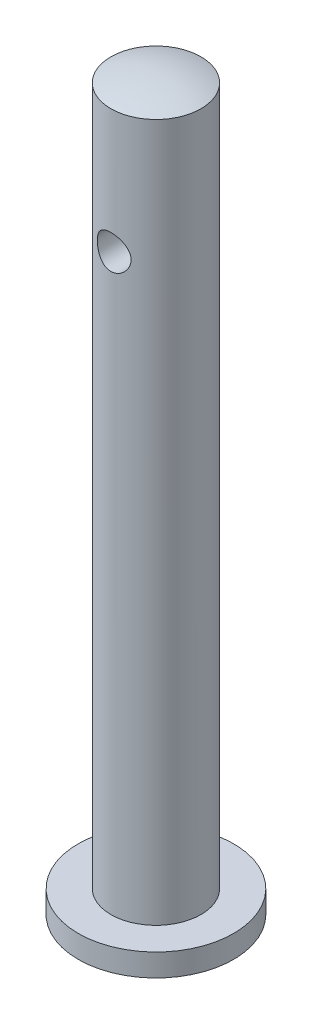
ISO-10303-21;
HEADER;
FILE_DESCRIPTION(('STEP AP214'),'2;1');
FILE_NAME('part.step','',(''),(''),'','','');
FILE_SCHEMA(('AUTOMOTIVE_DESIGN { 1 0 10303 214 1 1 1 1 }'));
ENDSEC;
DATA;
#1=APPLICATION_CONTEXT('core data for automotive mechanical design processes');
#2=APPLICATION_PROTOCOL_DEFINITION('international standard','automotive_design',2000,#1);
#3=PRODUCT_CONTEXT('',#1,'mechanical');
#4=PRODUCT('Part','Part','',(#3));
#5=PRODUCT_RELATED_PRODUCT_CATEGORY('part','',(#4));
#6=PRODUCT_DEFINITION_FORMATION('','',#4);
#7=PRODUCT_DEFINITION_CONTEXT('part definition',#1,'design');
#8=PRODUCT_DEFINITION('design','',#6,#7);
#9=PRODUCT_DEFINITION_SHAPE('','',#8);
#10=(LENGTH_UNIT() NAMED_UNIT(*) SI_UNIT(.MILLI.,.METRE.));
#11=(NAMED_UNIT(*) PLANE_ANGLE_UNIT() SI_UNIT($,.RADIAN.));
#12=(NAMED_UNIT(*) SI_UNIT($,.STERADIAN.) SOLID_ANGLE_UNIT());
#13=UNCERTAINTY_MEASURE_WITH_UNIT(LENGTH_MEASURE(1.E-05),#10,'distance_accuracy_value','');
#14=(GEOMETRIC_REPRESENTATION_CONTEXT(3) GLOBAL_UNCERTAINTY_ASSIGNED_CONTEXT((#13)) GLOBAL_UNIT_ASSIGNED_CONTEXT((#10,
#11,#12)) REPRESENTATION_CONTEXT('',''));
#15=CARTESIAN_POINT('',(0.,0.,0.));
#16=DIRECTION('',(0.,0.,1.));
#17=DIRECTION('',(1.,0.,0.));
#18=AXIS2_PLACEMENT_3D('',#15,#16,#17);
#19=CARTESIAN_POINT('',(-74.1520625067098,48.7236234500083,0.));
#20=DIRECTION('',(0.,1.,0.));
#21=DIRECTION('',(-1.,0.,0.));
#22=AXIS2_PLACEMENT_3D('',#19,#20,#21);
#23=SPHERICAL_SURFACE('',#22,11.6577075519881);
#24=CARTESIAN_POINT('',(-74.1520625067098,59.6736072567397,0.));
#25=DIRECTION('',(0.,1.,0.));
#26=DIRECTION('',(0.,0.,1.));
#27=AXIS2_PLACEMENT_3D('',#24,#25,#26);
#28=CIRCLE('',#27,4.);
#29=CARTESIAN_POINT('',(-74.1520625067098,59.6736072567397,4.));
#30=VERTEX_POINT('',#29);
#31=EDGE_CURVE('E10',#30,#30,#28,.T.);
#32=ORIENTED_EDGE('',*,*,#31,.T.);
#33=EDGE_LOOP('',(#32));
#34=FACE_BOUND('',#33,.T.);
#35=ADVANCED_FACE('F26',(#34),#23,.T.);
#36=CARTESIAN_POINT('',(-74.1520625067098,66.4098440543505,0.));
#37=DIRECTION('',(0.,1.,0.));
#38=DIRECTION('',(0.,0.,1.));
#39=AXIS2_PLACEMENT_3D('',#36,#37,#38);
#40=CYLINDRICAL_SURFACE('',#39,4.);
#41=CARTESIAN_POINT('',(-74.1520625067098,47.1557080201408,4.));
#42=CARTESIAN_POINT('',(-74.070827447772,47.1557051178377,4.00000217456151));
#43=CARTESIAN_POINT('',(-73.989612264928,47.1623277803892,3.99750379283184));
#44=CARTESIAN_POINT('',(-73.8296090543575,47.1885362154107,3.98778696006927));
#45=CARTESIAN_POINT('',(-73.7508206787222,47.2081201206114,3.98056918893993));
#46=CARTESIAN_POINT('',(-73.598001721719,47.2594610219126,3.96218832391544));
#47=CARTESIAN_POINT('',(-73.5239622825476,47.2911945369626,3.9510328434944));
#48=CARTESIAN_POINT('',(-73.3822631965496,47.3658144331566,3.92588767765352));
#49=CARTESIAN_POINT('',(-73.3146052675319,47.408703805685,3.91189723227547));
#50=CARTESIAN_POINT('',(-73.184716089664,47.5063205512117,3.88186246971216));
#51=CARTESIAN_POINT('',(-73.1227917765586,47.5614382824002,3.86576002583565));
#52=CARTESIAN_POINT('',(-73.0088182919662,47.6811184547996,3.83360220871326));
#53=CARTESIAN_POINT('',(-72.9567721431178,47.7456837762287,3.81754685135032));
#54=CARTESIAN_POINT('',(-72.86208048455,47.885425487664,3.78662470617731));
#55=CARTESIAN_POINT('',(-72.8198685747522,47.9609123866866,3.77182648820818));
#56=CARTESIAN_POINT('',(-72.748876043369,48.1185563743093,3.74599860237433));
#57=CARTESIAN_POINT('',(-72.7200900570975,48.2007107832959,3.73496742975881));
#58=CARTESIAN_POINT('',(-72.6779781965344,48.365824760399,3.71854412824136));
#59=CARTESIAN_POINT('',(-72.6640665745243,48.4486130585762,3.71293924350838));
#60=CARTESIAN_POINT('',(-72.6502669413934,48.6155241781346,3.70738061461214));
#61=CARTESIAN_POINT('',(-72.6503731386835,48.6996464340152,3.70742453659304));
#62=CARTESIAN_POINT('',(-72.6641582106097,48.8614775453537,3.71297511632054));
#63=CARTESIAN_POINT('',(-72.6770244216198,48.939268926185,3.71815468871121));
#64=CARTESIAN_POINT('',(-72.7146208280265,49.0914951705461,3.73284938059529));
#65=CARTESIAN_POINT('',(-72.7393528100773,49.1659295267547,3.74236515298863));
#66=CARTESIAN_POINT('',(-72.8004250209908,49.310985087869,3.76485702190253));
#67=CARTESIAN_POINT('',(-72.8369760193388,49.3815075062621,3.77789517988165));
#68=CARTESIAN_POINT('',(-72.9205017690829,49.5156537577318,3.80594210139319));
#69=CARTESIAN_POINT('',(-72.9674801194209,49.5792751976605,3.82095154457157));
#70=CARTESIAN_POINT('',(-73.0742446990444,49.7023116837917,3.85248038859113));
#71=CARTESIAN_POINT('',(-73.1346795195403,49.7611566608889,3.8690334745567));
#72=CARTESIAN_POINT('',(-73.2647499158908,49.8680459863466,3.90091728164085));
#73=CARTESIAN_POINT('',(-73.3343869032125,49.9160886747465,3.91624781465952));
#74=CARTESIAN_POINT('',(-73.4823390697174,50.0006384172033,3.9442639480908));
#75=CARTESIAN_POINT('',(-73.5607717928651,50.0369556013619,3.95690498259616));
#76=CARTESIAN_POINT('',(-73.7232256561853,50.0956906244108,3.97778718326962));
#77=CARTESIAN_POINT('',(-73.8072442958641,50.1181146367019,3.98603030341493));
#78=CARTESIAN_POINT('',(-73.9736872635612,50.1473308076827,3.99684443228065));
#79=CARTESIAN_POINT('',(-74.0559588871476,50.1548906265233,3.99969369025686));
#80=CARTESIAN_POINT('',(-74.2206349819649,50.1563990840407,4.00025893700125));
#81=CARTESIAN_POINT('',(-74.3030394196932,50.1503507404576,3.99797606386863));
#82=CARTESIAN_POINT('',(-74.4623245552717,50.1253979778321,3.98871709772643));
#83=CARTESIAN_POINT('',(-74.5392958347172,50.1069964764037,3.98192470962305));
#84=CARTESIAN_POINT('',(-74.6890042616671,50.0585219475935,3.96451477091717));
#85=CARTESIAN_POINT('',(-74.7617408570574,50.0284474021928,3.9538967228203));
#86=CARTESIAN_POINT('',(-74.90331027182,49.9565216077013,3.92949624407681));
#87=CARTESIAN_POINT('',(-74.9719655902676,49.9143502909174,3.91563000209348));
#88=CARTESIAN_POINT('',(-75.1014552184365,49.8197899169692,3.88626671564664));
#89=CARTESIAN_POINT('',(-75.1622866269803,49.7673970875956,3.87076907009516));
#90=CARTESIAN_POINT('',(-75.2780933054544,49.6503038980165,3.83873329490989));
#91=CARTESIAN_POINT('',(-75.3325240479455,49.5850658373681,3.82218696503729));
#92=CARTESIAN_POINT('',(-75.4297730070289,49.4460566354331,3.79078815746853));
#93=CARTESIAN_POINT('',(-75.472590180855,49.3722847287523,3.77593583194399));
#94=CARTESIAN_POINT('',(-75.5454402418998,49.2176920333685,3.74966829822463));
#95=CARTESIAN_POINT('',(-75.575419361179,49.1368432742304,3.73826760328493));
#96=CARTESIAN_POINT('',(-75.6211413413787,48.970698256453,3.72054032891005));
#97=CARTESIAN_POINT('',(-75.6368930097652,48.8854047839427,3.7142106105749));
#98=CARTESIAN_POINT('',(-75.6529259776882,48.7186918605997,3.70775894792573));
#99=CARTESIAN_POINT('',(-75.6541358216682,48.6373753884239,3.70726444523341));
#100=CARTESIAN_POINT('',(-75.6434296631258,48.4757627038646,3.71158412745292));
#101=CARTESIAN_POINT('',(-75.6315149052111,48.3954663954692,3.71639780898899));
#102=CARTESIAN_POINT('',(-75.5956206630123,48.2406607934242,3.73048141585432));
#103=CARTESIAN_POINT('',(-75.5720204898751,48.1660496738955,3.73961085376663));
#104=CARTESIAN_POINT('',(-75.513759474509,48.0218025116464,3.76121548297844));
#105=CARTESIAN_POINT('',(-75.4790958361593,47.9521677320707,3.77369151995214));
#106=CARTESIAN_POINT('',(-75.3975832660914,47.8158812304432,3.80139723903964));
#107=CARTESIAN_POINT('',(-75.3501908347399,47.7495772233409,3.81673698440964));
#108=CARTESIAN_POINT('',(-75.2454073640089,47.6255664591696,3.84806246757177));
#109=CARTESIAN_POINT('',(-75.1880131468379,47.567862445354,3.86404840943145));
#110=CARTESIAN_POINT('',(-75.0611429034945,47.459506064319,3.89590424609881));
#111=CARTESIAN_POINT('',(-74.9911811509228,47.4094042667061,3.91172104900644));
#112=CARTESIAN_POINT('',(-74.8432757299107,47.3216853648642,3.9405451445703));
#113=CARTESIAN_POINT('',(-74.7653314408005,47.2840692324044,3.95355221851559));
#114=CARTESIAN_POINT('',(-74.6000615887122,47.2213311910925,3.9757429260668));
#115=CARTESIAN_POINT('',(-74.5124759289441,47.1968209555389,3.98473657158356));
#116=CARTESIAN_POINT('',(-74.3339382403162,47.1640150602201,3.99686242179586));
#117=CARTESIAN_POINT('',(-74.2429879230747,47.1557112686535,3.99999756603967));
#118=CARTESIAN_POINT('',(-74.1520625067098,47.1557080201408,4.));
#119=B_SPLINE_CURVE_WITH_KNOTS('',3,(#41,#42,#43,#44,#45,#46,#47,#48,#49,#50,#51,#52,#53,#54,
#55,#56,#57,#58,#59,#60,#61,#62,#63,#64,#65,#66,#67,#68,#69,#70,#71,#72,#73,#74,#75,#76,#77,#78,
#79,#80,#81,#82,#83,#84,#85,#86,#87,#88,#89,#90,#91,#92,#93,#94,#95,#96,#97,#98,#99,#100,#101,
#102,#103,#104,#105,#106,#107,#108,#109,#110,#111,#112,#113,#114,#115,#116,#117,#118),
.UNSPECIFIED.,.T.,.F.,(4,2,2,2,2,2,2,2,2,2,2,2,2,2,2,2,2,2,2,2,2,2,2,2,2,2,2,2,2,2,2,2,2,2,2,2,
2,2,4),(0.,0.243369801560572,0.48670454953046,0.729571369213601,0.972503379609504,
1.22473618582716,1.47704604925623,1.73896674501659,2.00078269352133,2.251858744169,
2.50283106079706,2.73878345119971,2.97477138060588,3.21522408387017,3.45575990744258,
3.71246153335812,3.96920257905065,4.22991375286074,4.49050899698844,4.73725019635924,
4.9839366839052,5.22114437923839,5.45838293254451,5.70259221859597,5.94689180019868,
6.20536519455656,6.46386178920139,6.72343066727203,6.98283874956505,7.2255876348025,
7.46831350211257,7.70363142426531,7.93900886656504,8.1867247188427,8.43451941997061,
8.69572329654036,8.95694749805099,9.22948515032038,9.50188601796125),.UNSPECIFIED.);
#120=CARTESIAN_POINT('',(-74.1520625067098,47.1557080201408,4.));
#121=VERTEX_POINT('',#120);
#122=EDGE_CURVE('E29',#121,#121,#119,.T.);
#123=ORIENTED_EDGE('',*,*,#122,.F.);
#124=EDGE_LOOP('',(#123));
#125=FACE_BOUND('',#124,.T.);
#126=CARTESIAN_POINT('',(-72.6520625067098,48.6557080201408,-3.70809924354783));
#127=CARTESIAN_POINT('',(-72.6520594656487,48.57470053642,-3.70809640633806));
#128=CARTESIAN_POINT('',(-72.658646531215,48.4937130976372,-3.71078260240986));
#129=CARTESIAN_POINT('',(-72.6847006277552,48.3341799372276,-3.72116159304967));
#130=CARTESIAN_POINT('',(-72.7041672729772,48.2556341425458,-3.72885423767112));
#131=CARTESIAN_POINT('',(-72.7551659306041,48.1033326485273,-3.748254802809));
#132=CARTESIAN_POINT('',(-72.7866690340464,48.0295659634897,-3.7599530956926));
#133=CARTESIAN_POINT('',(-72.8607439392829,47.8883361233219,-3.78603134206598));
#134=CARTESIAN_POINT('',(-72.9033190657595,47.8208748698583,-3.80041210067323));
#135=CARTESIAN_POINT('',(-73.0005958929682,47.690817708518,-3.83103574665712));
#136=CARTESIAN_POINT('',(-73.0557586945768,47.6285794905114,-3.84733341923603));
#137=CARTESIAN_POINT('',(-73.1756666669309,47.5139852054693,-3.87949750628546));
#138=CARTESIAN_POINT('',(-73.2404138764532,47.4616312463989,-3.89536382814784));
#139=CARTESIAN_POINT('',(-73.3803678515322,47.3665685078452,-3.92552873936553));
#140=CARTESIAN_POINT('',(-73.4558555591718,47.3242485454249,-3.93975561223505));
#141=CARTESIAN_POINT('',(-73.6135067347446,47.2530568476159,-3.96438007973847));
#142=CARTESIAN_POINT('',(-73.6956678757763,47.2241804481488,-3.97477900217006));
#143=CARTESIAN_POINT('',(-73.860573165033,47.1819501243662,-3.99018697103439));
#144=CARTESIAN_POINT('',(-73.9431393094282,47.1679803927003,-3.99540915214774));
#145=CARTESIAN_POINT('',(-74.1095981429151,47.1539868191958,-4.0006401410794));
#146=CARTESIAN_POINT('',(-74.1934903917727,47.1539584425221,-4.00065064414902));
#147=CARTESIAN_POINT('',(-74.3558060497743,47.167489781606,-3.99559265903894));
#148=CARTESIAN_POINT('',(-74.4342946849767,47.1803773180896,-3.99077541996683));
#149=CARTESIAN_POINT('',(-74.5879017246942,47.2182439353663,-3.97693274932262));
#150=CARTESIAN_POINT('',(-74.6630198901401,47.2432238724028,-3.96790701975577));
#151=CARTESIAN_POINT('',(-74.8090515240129,47.3048784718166,-3.9463776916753));
#152=CARTESIAN_POINT('',(-74.8798878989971,47.3417180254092,-3.93382539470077));
#153=CARTESIAN_POINT('',(-75.0145491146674,47.4259001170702,-3.90651310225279));
#154=CARTESIAN_POINT('',(-75.0783716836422,47.4732460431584,-3.8917523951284));
#155=CARTESIAN_POINT('',(-75.2011529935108,47.580335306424,-3.86052529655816));
#156=CARTESIAN_POINT('',(-75.2596086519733,47.6406419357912,-3.84400963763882));
#157=CARTESIAN_POINT('',(-75.3657664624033,47.7703010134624,-3.81182460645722));
#158=CARTESIAN_POINT('',(-75.4134659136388,47.8396557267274,-3.79615544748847));
#159=CARTESIAN_POINT('',(-75.4977186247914,47.9874274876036,-3.76712703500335));
#160=CARTESIAN_POINT('',(-75.5340009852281,48.0660115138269,-3.75382677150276));
#161=CARTESIAN_POINT('',(-75.5926271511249,48.2288042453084,-3.73172438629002));
#162=CARTESIAN_POINT('',(-75.6149787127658,48.3130097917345,-3.72291976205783));
#163=CARTESIAN_POINT('',(-75.6439644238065,48.4796839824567,-3.71139597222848));
#164=CARTESIAN_POINT('',(-75.6513977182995,48.5619921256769,-3.70836785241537));
#165=CARTESIAN_POINT('',(-75.6526413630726,48.7267173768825,-3.70786539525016));
#166=CARTESIAN_POINT('',(-75.6464551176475,48.8091344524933,-3.71038967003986));
#167=CARTESIAN_POINT('',(-75.6213598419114,48.9676379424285,-3.72039381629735));
#168=CARTESIAN_POINT('',(-75.6030686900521,49.0438391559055,-3.72763276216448));
#169=CARTESIAN_POINT('',(-75.5550602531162,49.192055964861,-3.74596487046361));
#170=CARTESIAN_POINT('',(-75.5253406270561,49.2640706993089,-3.75705882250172));
#171=CARTESIAN_POINT('',(-75.4540654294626,49.404872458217,-3.78236243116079));
#172=CARTESIAN_POINT('',(-75.4121079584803,49.4734373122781,-3.79667328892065));
#173=CARTESIAN_POINT('',(-75.3179756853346,49.6028370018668,-3.82662814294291));
#174=CARTESIAN_POINT('',(-75.2657971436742,49.6636689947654,-3.84227262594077));
#175=CARTESIAN_POINT('',(-75.1487898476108,49.7798763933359,-3.87433046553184));
#176=CARTESIAN_POINT('',(-75.0833688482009,49.8346614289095,-3.89072969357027));
#177=CARTESIAN_POINT('',(-74.943859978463,49.9325463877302,-3.92149874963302));
#178=CARTESIAN_POINT('',(-74.8697720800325,49.9756462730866,-3.93586857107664));
#179=CARTESIAN_POINT('',(-74.7150788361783,50.0486540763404,-3.96094985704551));
#180=CARTESIAN_POINT('',(-74.6344969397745,50.0786071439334,-3.9716738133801));
#181=CARTESIAN_POINT('',(-74.4689443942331,50.1243644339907,-3.98829436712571));
#182=CARTESIAN_POINT('',(-74.3839758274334,50.1401753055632,-3.99419323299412));
#183=CARTESIAN_POINT('',(-74.2173980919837,50.1564824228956,-4.00028407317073));
#184=CARTESIAN_POINT('',(-74.135881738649,50.1578175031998,-4.00078860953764));
#185=CARTESIAN_POINT('',(-73.9738357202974,50.1472928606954,-3.99684889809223));
#186=CARTESIAN_POINT('',(-73.8933059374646,50.1354347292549,-3.9924052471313));
#187=CARTESIAN_POINT('',(-73.7375142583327,50.0994491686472,-3.97921089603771));
#188=CARTESIAN_POINT('',(-73.662171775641,50.0756281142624,-3.97056791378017));
#189=CARTESIAN_POINT('',(-73.5165470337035,50.0166980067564,-3.94987783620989));
#190=CARTESIAN_POINT('',(-73.4462657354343,49.981586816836,-3.93783009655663));
#191=CARTESIAN_POINT('',(-73.3095223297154,49.899394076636,-3.91090618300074));
#192=CARTESIAN_POINT('',(-73.243344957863,49.8518713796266,-3.89593240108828));
#193=CARTESIAN_POINT('',(-73.1196451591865,49.7469001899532,-3.86499507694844));
#194=CARTESIAN_POINT('',(-73.0621258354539,49.6894481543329,-3.84903118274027));
#195=CARTESIAN_POINT('',(-72.9542503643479,49.5626438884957,-3.81688129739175));
#196=CARTESIAN_POINT('',(-72.9044325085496,49.4928236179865,-3.80072805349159));
#197=CARTESIAN_POINT('',(-72.8172154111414,49.3452921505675,-3.77098325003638));
#198=CARTESIAN_POINT('',(-72.7798174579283,49.2675801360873,-3.75739195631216));
#199=CARTESIAN_POINT('',(-72.7174036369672,49.1027523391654,-3.73402269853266));
#200=CARTESIAN_POINT('',(-72.6930024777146,49.015373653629,-3.7244380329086));
#201=CARTESIAN_POINT('',(-72.6603389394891,48.837222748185,-3.71147994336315));
#202=CARTESIAN_POINT('',(-72.6520659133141,48.7464528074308,-3.70810242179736));
#203=CARTESIAN_POINT('',(-72.6520625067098,48.6557080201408,-3.70809924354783));
#204=B_SPLINE_CURVE_WITH_KNOTS('',3,(#126,#127,#128,#129,#130,#131,#132,#133,#134,#135,#136,
#137,#138,#139,#140,#141,#142,#143,#144,#145,#146,#147,#148,#149,#150,#151,#152,#153,#154,#155,
#156,#157,#158,#159,#160,#161,#162,#163,#164,#165,#166,#167,#168,#169,#170,#171,#172,#173,#174,
#175,#176,#177,#178,#179,#180,#181,#182,#183,#184,#185,#186,#187,#188,#189,#190,#191,#192,#193,
#194,#195,#196,#197,#198,#199,#200,#201,#202,#203),.UNSPECIFIED.,.T.,.F.,(4,2,2,2,2,2,2,2,2,2,2,
2,2,2,2,2,2,2,2,2,2,2,2,2,2,2,2,2,2,2,2,2,2,2,2,2,2,2,4),(0.,0.242684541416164,
0.485361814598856,0.727459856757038,0.969630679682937,1.22274652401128,1.47591628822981,
1.73770072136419,1.9993942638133,2.24980018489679,2.50012465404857,2.73806472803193,
2.97602165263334,3.21744131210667,3.45893893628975,3.71456675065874,3.97025867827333,
4.23162592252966,4.49284751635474,4.73965657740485,4.98640395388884,5.22143845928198,
5.45652113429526,5.70041561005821,5.94439948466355,6.20385016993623,6.46330169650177,
6.72185508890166,6.98028685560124,7.22365720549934,7.46699820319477,7.70440274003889,
7.94185223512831,8.18928323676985,8.43680270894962,8.69738599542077,8.95799630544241,
9.23003178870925,9.50188762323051),.UNSPECIFIED.);
#205=CARTESIAN_POINT('',(-72.6520625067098,48.6557080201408,-3.70809924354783));
#206=VERTEX_POINT('',#205);
#207=EDGE_CURVE('E44',#206,#206,#204,.T.);
#208=ORIENTED_EDGE('',*,*,#207,.F.);
#209=EDGE_LOOP('',(#208));
#210=FACE_BOUND('',#209,.T.);
#211=CARTESIAN_POINT('',(-74.1520625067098,-2.31027214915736,0.));
#212=DIRECTION('',(0.,1.,0.));
#213=DIRECTION('',(0.,0.,1.));
#214=AXIS2_PLACEMENT_3D('',#211,#212,#213);
#215=CIRCLE('',#214,3.99999999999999);
#216=CARTESIAN_POINT('',(-74.1520625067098,-2.31027214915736,3.99999999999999));
#217=VERTEX_POINT('',#216);
#218=EDGE_CURVE('E36',#217,#217,#215,.T.);
#219=ORIENTED_EDGE('',*,*,#218,.T.);
#220=EDGE_LOOP('',(#219));
#221=FACE_BOUND('',#220,.T.);
#222=ORIENTED_EDGE('',*,*,#31,.F.);
#223=EDGE_LOOP('',(#222));
#224=FACE_BOUND('',#223,.T.);
#225=ADVANCED_FACE('F48',(#125,#210,#221,#224),#40,.T.);
#226=CARTESIAN_POINT('',(-78.1520625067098,-2.31027214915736,0.));
#227=DIRECTION('',(0.,1.,0.));
#228=DIRECTION('',(0.,0.,1.));
#229=AXIS2_PLACEMENT_3D('',#226,#227,#228);
#230=PLANE('',#229);
#231=CARTESIAN_POINT('',(-74.1520625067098,-2.31027214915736,0.));
#232=DIRECTION('',(0.,1.,0.));
#233=DIRECTION('',(0.,0.,1.));
#234=AXIS2_PLACEMENT_3D('',#231,#232,#233);
#235=CIRCLE('',#234,6.90144617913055);
#236=CARTESIAN_POINT('',(-74.1520625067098,-2.31027214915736,6.90144617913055));
#237=VERTEX_POINT('',#236);
#238=EDGE_CURVE('E41',#237,#237,#235,.T.);
#239=ORIENTED_EDGE('',*,*,#238,.T.);
#240=EDGE_LOOP('',(#239));
#241=FACE_BOUND('',#240,.T.);
#242=ORIENTED_EDGE('',*,*,#218,.F.);
#243=EDGE_LOOP('',(#242));
#244=FACE_BOUND('',#243,.T.);
#245=ADVANCED_FACE('F63',(#241,#244),#230,.T.);
#246=CARTESIAN_POINT('',(-74.1520625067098,66.4098440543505,0.));
#247=DIRECTION('',(0.,1.,0.));
#248=DIRECTION('',(0.,0.,1.));
#249=AXIS2_PLACEMENT_3D('',#246,#247,#248);
#250=CYLINDRICAL_SURFACE('',#249,6.90144617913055);
#251=CARTESIAN_POINT('',(-74.1520625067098,-4.31027214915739,0.));
#252=DIRECTION('',(0.,1.,0.));
#253=DIRECTION('',(0.,0.,1.));
#254=AXIS2_PLACEMENT_3D('',#251,#252,#253);
#255=CIRCLE('',#254,6.90144617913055);
#256=CARTESIAN_POINT('',(-74.1520625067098,-4.31027214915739,6.90144617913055));
#257=VERTEX_POINT('',#256);
#258=EDGE_CURVE('E113',#257,#257,#255,.T.);
#259=ORIENTED_EDGE('',*,*,#258,.T.);
#260=EDGE_LOOP('',(#259));
#261=FACE_BOUND('',#260,.T.);
#262=ORIENTED_EDGE('',*,*,#238,.F.);
#263=EDGE_LOOP('',(#262));
#264=FACE_BOUND('',#263,.T.);
#265=ADVANCED_FACE('F60',(#261,#264),#250,.T.);
#266=CARTESIAN_POINT('',(-74.1520625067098,10.5032542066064,0.));
#267=DIRECTION('',(0.,1.,0.));
#268=DIRECTION('',(-1.,0.,0.));
#269=AXIS2_PLACEMENT_3D('',#266,#267,#268);
#270=SPHERICAL_SURFACE('',#269,16.3422924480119);
#271=ORIENTED_EDGE('',*,*,#258,.F.);
#272=EDGE_LOOP('',(#271));
#273=FACE_BOUND('',#272,.T.);
#274=ADVANCED_FACE('F55',(#273),#270,.T.);
#275=CARTESIAN_POINT('',(-74.1520625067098,48.6557080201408,-6.90144617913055));
#276=DIRECTION('',(0.,0.,1.));
#277=DIRECTION('',(1.,0.,0.));
#278=AXIS2_PLACEMENT_3D('',#275,#276,#277);
#279=CYLINDRICAL_SURFACE('',#278,1.5);
#280=ORIENTED_EDGE('',*,*,#122,.T.);
#281=EDGE_LOOP('',(#280));
#282=FACE_BOUND('',#281,.T.);
#283=ORIENTED_EDGE('',*,*,#207,.T.);
#284=EDGE_LOOP('',(#283));
#285=FACE_BOUND('',#284,.T.);
#286=ADVANCED_FACE('F51',(#282,#285),#279,.F.);
#287=CLOSED_SHELL('',(#35,#225,#245,#265,#274,#286));
#288=MANIFOLD_SOLID_BREP('B2',#287);
#289=ADVANCED_BREP_SHAPE_REPRESENTATION('',(#18,#288),#14);
#290=SHAPE_DEFINITION_REPRESENTATION(#9,#289);
ENDSEC;
END-ISO-10303-21;
